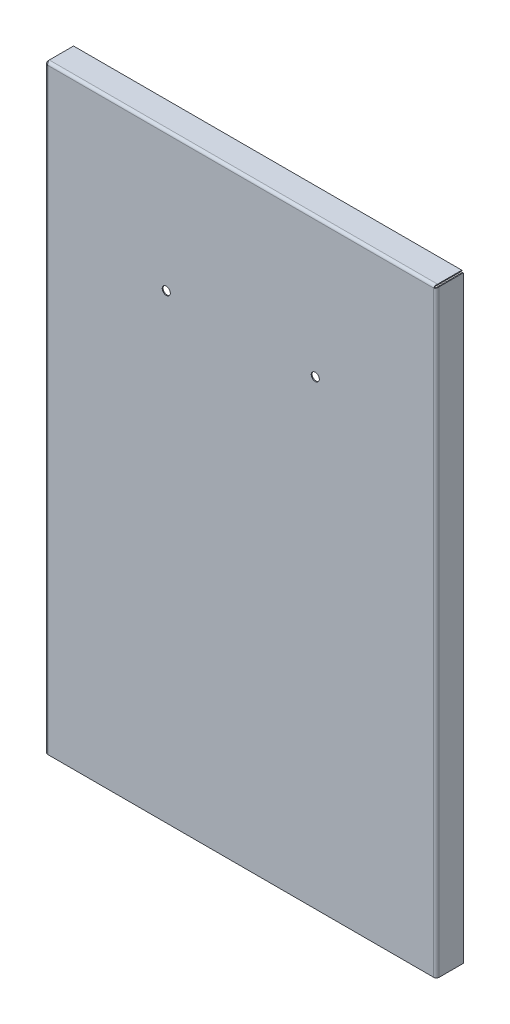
ISO-10303-21;
HEADER;
FILE_DESCRIPTION(('STEP AP214'),'2;1');
FILE_NAME('part.step','',(''),(''),'','','');
FILE_SCHEMA(('AUTOMOTIVE_DESIGN { 1 0 10303 214 1 1 1 1 }'));
ENDSEC;
DATA;
#1=APPLICATION_CONTEXT('core data for automotive mechanical design processes');
#2=APPLICATION_PROTOCOL_DEFINITION('international standard','automotive_design',2000,#1);
#3=PRODUCT_CONTEXT('',#1,'mechanical');
#4=PRODUCT('Part','Part','',(#3));
#5=PRODUCT_RELATED_PRODUCT_CATEGORY('part','',(#4));
#6=PRODUCT_DEFINITION_FORMATION('','',#4);
#7=PRODUCT_DEFINITION_CONTEXT('part definition',#1,'design');
#8=PRODUCT_DEFINITION('design','',#6,#7);
#9=PRODUCT_DEFINITION_SHAPE('','',#8);
#10=(LENGTH_UNIT() NAMED_UNIT(*) SI_UNIT(.MILLI.,.METRE.));
#11=(NAMED_UNIT(*) PLANE_ANGLE_UNIT() SI_UNIT($,.RADIAN.));
#12=(NAMED_UNIT(*) SI_UNIT($,.STERADIAN.) SOLID_ANGLE_UNIT());
#13=UNCERTAINTY_MEASURE_WITH_UNIT(LENGTH_MEASURE(1.E-05),#10,'distance_accuracy_value','');
#14=(GEOMETRIC_REPRESENTATION_CONTEXT(3) GLOBAL_UNCERTAINTY_ASSIGNED_CONTEXT((#13)) GLOBAL_UNIT_ASSIGNED_CONTEXT((#10,
#11,#12)) REPRESENTATION_CONTEXT('',''));
#15=CARTESIAN_POINT('',(0.,0.,0.));
#16=DIRECTION('',(0.,0.,1.));
#17=DIRECTION('',(1.,0.,0.));
#18=AXIS2_PLACEMENT_3D('',#15,#16,#17);
#19=CARTESIAN_POINT('',(0.,0.,0.));
#20=DIRECTION('',(0.,0.,-1.));
#21=DIRECTION('',(-1.,0.,0.));
#22=AXIS2_PLACEMENT_3D('',#19,#20,#21);
#23=PLANE('',#22);
#24=CARTESIAN_POINT('',(83.,179.41245810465,0.));
#25=DIRECTION('',(0.,0.,-1.));
#26=DIRECTION('',(-1.,0.,0.));
#27=AXIS2_PLACEMENT_3D('',#24,#25,#26);
#28=CIRCLE('',#27,4.50000000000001);
#29=CARTESIAN_POINT('',(78.5,179.41245810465,0.));
#30=VERTEX_POINT('',#29);
#31=EDGE_CURVE('E846',#30,#30,#28,.T.);
#32=ORIENTED_EDGE('',*,*,#31,.F.);
#33=EDGE_LOOP('',(#32));
#34=FACE_BOUND('',#33,.T.);
#35=CARTESIAN_POINT('',(-83.,179.41245810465,0.));
#36=DIRECTION('',(0.,0.,-1.));
#37=DIRECTION('',(-1.,0.,0.));
#38=AXIS2_PLACEMENT_3D('',#35,#36,#37);
#39=CIRCLE('',#38,4.50000000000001);
#40=CARTESIAN_POINT('',(-87.5,179.41245810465,0.));
#41=VERTEX_POINT('',#40);
#42=EDGE_CURVE('E243',#41,#41,#39,.T.);
#43=ORIENTED_EDGE('',*,*,#42,.F.);
#44=EDGE_LOOP('',(#43));
#45=FACE_BOUND('',#44,.T.);
#46=DIRECTION('',(1.,0.,0.));
#47=VECTOR('',#46,1.);
#48=CARTESIAN_POINT('',(-218.,-334.,0.));
#49=LINE('',#48,#47);
#50=CARTESIAN_POINT('',(-215.,-334.,0.));
#51=VERTEX_POINT('',#50);
#52=CARTESIAN_POINT('',(215.,-334.,0.));
#53=VERTEX_POINT('',#52);
#54=EDGE_CURVE('E13',#51,#53,#49,.T.);
#55=ORIENTED_EDGE('',*,*,#54,.F.);
#56=DIRECTION('',(0.,1.,0.));
#57=VECTOR('',#56,1.);
#58=CARTESIAN_POINT('',(-215.,332.292893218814,0.));
#59=LINE('',#58,#57);
#60=CARTESIAN_POINT('',(-215.,331.,0.));
#61=VERTEX_POINT('',#60);
#62=EDGE_CURVE('E253',#61,#51,#59,.F.);
#63=ORIENTED_EDGE('',*,*,#62,.F.);
#64=DIRECTION('',(1.,0.,0.));
#65=VECTOR('',#64,1.);
#66=CARTESIAN_POINT('',(216.292893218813,331.,0.));
#67=LINE('',#66,#65);
#68=CARTESIAN_POINT('',(215.,331.,0.));
#69=VERTEX_POINT('',#68);
#70=EDGE_CURVE('E119',#69,#61,#67,.F.);
#71=ORIENTED_EDGE('',*,*,#70,.F.);
#72=DIRECTION('',(0.,-1.,0.));
#73=VECTOR('',#72,1.);
#74=CARTESIAN_POINT('',(215.,-334.,0.));
#75=LINE('',#74,#73);
#76=EDGE_CURVE('E418',#53,#69,#75,.F.);
#77=ORIENTED_EDGE('',*,*,#76,.F.);
#78=EDGE_LOOP('',(#55,#63,#71,#77));
#79=FACE_BOUND('',#78,.T.);
#80=ADVANCED_FACE('F99',(#34,#45,#79),#23,.T.);
#81=CARTESIAN_POINT('',(0.,0.,1.));
#82=DIRECTION('',(0.,0.,-1.));
#83=DIRECTION('',(-1.,0.,0.));
#84=AXIS2_PLACEMENT_3D('',#81,#82,#83);
#85=PLANE('',#84);
#86=CARTESIAN_POINT('',(83.,179.41245810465,1.));
#87=DIRECTION('',(0.,0.,1.));
#88=DIRECTION('',(1.,0.,0.));
#89=AXIS2_PLACEMENT_3D('',#86,#87,#88);
#90=CIRCLE('',#89,4.50000000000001);
#91=CARTESIAN_POINT('',(87.5,179.41245810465,1.));
#92=VERTEX_POINT('',#91);
#93=EDGE_CURVE('E849',#92,#92,#90,.T.);
#94=ORIENTED_EDGE('',*,*,#93,.F.);
#95=EDGE_LOOP('',(#94));
#96=FACE_BOUND('',#95,.T.);
#97=CARTESIAN_POINT('',(-83.,179.41245810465,1.));
#98=DIRECTION('',(0.,0.,1.));
#99=DIRECTION('',(1.,0.,0.));
#100=AXIS2_PLACEMENT_3D('',#97,#98,#99);
#101=CIRCLE('',#100,4.50000000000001);
#102=CARTESIAN_POINT('',(-78.5,179.41245810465,1.));
#103=VERTEX_POINT('',#102);
#104=EDGE_CURVE('E851',#103,#103,#101,.T.);
#105=ORIENTED_EDGE('',*,*,#104,.F.);
#106=EDGE_LOOP('',(#105));
#107=FACE_BOUND('',#106,.T.);
#108=DIRECTION('',(0.,1.,0.));
#109=VECTOR('',#108,1.);
#110=CARTESIAN_POINT('',(-215.,332.292893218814,0.999999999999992));
#111=LINE('',#110,#109);
#112=CARTESIAN_POINT('',(-215.,331.,0.999999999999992));
#113=VERTEX_POINT('',#112);
#114=CARTESIAN_POINT('',(-215.,-334.,1.));
#115=VERTEX_POINT('',#114);
#116=EDGE_CURVE('E248',#113,#115,#111,.F.);
#117=ORIENTED_EDGE('',*,*,#116,.T.);
#118=DIRECTION('',(-1.,0.,0.));
#119=VECTOR('',#118,1.);
#120=CARTESIAN_POINT('',(0.,-334.,1.));
#121=LINE('',#120,#119);
#122=CARTESIAN_POINT('',(215.,-334.,0.999999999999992));
#123=VERTEX_POINT('',#122);
#124=EDGE_CURVE('E103',#115,#123,#121,.F.);
#125=ORIENTED_EDGE('',*,*,#124,.T.);
#126=DIRECTION('',(0.,-1.,0.));
#127=VECTOR('',#126,1.);
#128=CARTESIAN_POINT('',(215.,-334.,0.999999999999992));
#129=LINE('',#128,#127);
#130=CARTESIAN_POINT('',(215.,331.,0.999999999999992));
#131=VERTEX_POINT('',#130);
#132=EDGE_CURVE('E494',#123,#131,#129,.F.);
#133=ORIENTED_EDGE('',*,*,#132,.T.);
#134=DIRECTION('',(1.,0.,0.));
#135=VECTOR('',#134,1.);
#136=CARTESIAN_POINT('',(216.292893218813,331.,0.999999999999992));
#137=LINE('',#136,#135);
#138=EDGE_CURVE('E371',#131,#113,#137,.F.);
#139=ORIENTED_EDGE('',*,*,#138,.T.);
#140=EDGE_LOOP('',(#117,#125,#133,#139));
#141=FACE_BOUND('',#140,.T.);
#142=ADVANCED_FACE('F303',(#96,#107,#141),#85,.F.);
#143=CARTESIAN_POINT('',(-218.,-334.,0.));
#144=DIRECTION('',(0.,1.,0.));
#145=DIRECTION('',(1.,0.,0.));
#146=AXIS2_PLACEMENT_3D('',#143,#144,#145);
#147=PLANE('',#146);
#148=DIRECTION('',(0.,0.,1.));
#149=VECTOR('',#148,1.);
#150=CARTESIAN_POINT('',(-215.,-334.,0.));
#151=LINE('',#150,#149);
#152=EDGE_CURVE('E247',#51,#115,#151,.T.);
#153=ORIENTED_EDGE('',*,*,#152,.F.);
#154=ORIENTED_EDGE('',*,*,#54,.T.);
#155=DIRECTION('',(0.,0.,1.));
#156=VECTOR('',#155,1.);
#157=CARTESIAN_POINT('',(215.,-334.,0.));
#158=LINE('',#157,#156);
#159=EDGE_CURVE('E384',#53,#123,#158,.T.);
#160=ORIENTED_EDGE('',*,*,#159,.T.);
#161=ORIENTED_EDGE('',*,*,#124,.F.);
#162=EDGE_LOOP('',(#153,#154,#160,#161));
#163=FACE_BOUND('',#162,.T.);
#164=ADVANCED_FACE('F101',(#163),#147,.F.);
#165=CARTESIAN_POINT('',(-215.,331.,1.00999999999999));
#166=CARTESIAN_POINT('',(-215.10775918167,331.394074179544,1.00999999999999));
#167=CARTESIAN_POINT('',(-215.215482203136,331.787861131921,0.931657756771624));
#168=CARTESIAN_POINT('',(-215.430964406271,332.515893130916,0.630097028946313));
#169=CARTESIAN_POINT('',(-215.538705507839,332.849785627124,0.406997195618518));
#170=CARTESIAN_POINT('',(-215.754187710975,333.406997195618,-0.150214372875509));
#171=CARTESIAN_POINT('',(-215.861928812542,333.630097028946,-0.484106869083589));
#172=CARTESIAN_POINT('',(-216.077411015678,333.931657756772,-1.21213886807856));
#173=CARTESIAN_POINT('',(-216.185134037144,334.01,-1.60592582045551));
#174=CARTESIAN_POINT('',(-216.292893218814,334.01,-2.));
#175=CARTESIAN_POINT('',(-215.,331.,0.999999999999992));
#176=CARTESIAN_POINT('',(-215.107759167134,331.392764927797,0.999999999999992));
#177=CARTESIAN_POINT('',(-215.215482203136,331.785243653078,0.921918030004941));
#178=CARTESIAN_POINT('',(-215.430964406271,332.510856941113,0.62135916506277));
#179=CARTESIAN_POINT('',(-215.538705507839,332.843640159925,0.399000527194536));
#180=CARTESIAN_POINT('',(-215.754187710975,333.399000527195,-0.156359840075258));
#181=CARTESIAN_POINT('',(-215.861928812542,333.621359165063,-0.489143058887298));
#182=CARTESIAN_POINT('',(-216.077411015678,333.921918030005,-1.21475634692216));
#183=CARTESIAN_POINT('',(-216.18513405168,334.,-1.60723507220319));
#184=CARTESIAN_POINT('',(-216.292893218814,334.,-2.));
#185=CARTESIAN_POINT('',(-215.,331.,0.));
#186=CARTESIAN_POINT('',(-215.107757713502,331.261839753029,0.));
#187=CARTESIAN_POINT('',(-215.215482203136,331.523495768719,-0.0520546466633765));
#188=CARTESIAN_POINT('',(-215.430964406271,332.007237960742,-0.252427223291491));
#189=CARTESIAN_POINT('',(-215.538705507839,332.22909343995,-0.400666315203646));
#190=CARTESIAN_POINT('',(-215.754187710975,332.599333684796,-0.770906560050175));
#191=CARTESIAN_POINT('',(-215.861928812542,332.747572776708,-0.992762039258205));
#192=CARTESIAN_POINT('',(-216.077411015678,332.947945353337,-1.47650423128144));
#193=CARTESIAN_POINT('',(-216.185135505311,333.,-1.73816024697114));
#194=CARTESIAN_POINT('',(-216.292893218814,333.,-2.));
#195=CARTESIAN_POINT('',(-215.,331.,-0.0101000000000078));
#196=CARTESIAN_POINT('',(-215.107757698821,331.260517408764,-0.0101000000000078));
#197=CARTESIAN_POINT('',(-215.215482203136,331.520852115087,-0.0618917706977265));
#198=CARTESIAN_POINT('',(-215.430964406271,332.00215140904,-0.261252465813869));
#199=CARTESIAN_POINT('',(-215.538705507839,332.222886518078,-0.408742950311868));
#200=CARTESIAN_POINT('',(-215.754187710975,332.591257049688,-0.777113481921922));
#201=CARTESIAN_POINT('',(-215.861928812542,332.738747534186,-0.997848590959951));
#202=CARTESIAN_POINT('',(-216.077411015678,332.938108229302,-1.47914788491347));
#203=CARTESIAN_POINT('',(-216.185135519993,332.9899,-1.73948259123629));
#204=CARTESIAN_POINT('',(-216.292893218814,332.9899,-2.));
#205=B_SPLINE_SURFACE_WITH_KNOTS('',1,3,((#165,#166,#167,#168,#169,#170,#171,#172,#173,#174),
(#175,#176,#177,#178,#179,#180,#181,#182,#183,#184),(#185,#186,#187,#188,#189,#190,#191,#192,
#193,#194),(#195,#196,#197,#198,#199,#200,#201,#202,#203,#204)),.UNSPECIFIED.,.F.,.F.,.F.,(2,1,
1,2),(4,2,2,2,4),(-0.01,0.,1.,1.0101),(0.,0.25,0.5,0.75,1.),.UNSPECIFIED.);
#206=DIRECTION('',(0.,-1.,0.));
#207=VECTOR('',#206,1.);
#208=CARTESIAN_POINT('',(-216.292893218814,333.,-2.));
#209=LINE('',#208,#207);
#210=CARTESIAN_POINT('',(-216.292893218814,334.,-2.));
#211=VERTEX_POINT('',#210);
#212=CARTESIAN_POINT('',(-216.292893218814,333.,-2.));
#213=VERTEX_POINT('',#212);
#214=EDGE_CURVE('E346',#211,#213,#209,.T.);
#215=CARTESIAN_POINT('',(-215.,331.,0.));
#216=CARTESIAN_POINT('',(-215.025041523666,331.060845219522,7.4837045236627E-06));
#217=CARTESIAN_POINT('',(-215.050081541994,331.121687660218,-0.00277654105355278));
#218=CARTESIAN_POINT('',(-215.100159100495,331.242863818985,-0.0138703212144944));
#219=CARTESIAN_POINT('',(-215.125196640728,331.303197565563,-0.0221797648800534));
#220=CARTESIAN_POINT('',(-215.175252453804,331.422812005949,-0.0442582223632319));
#221=CARTESIAN_POINT('',(-215.200270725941,331.482093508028,-0.0580228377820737));
#222=CARTESIAN_POINT('',(-215.250302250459,331.599141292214,-0.0908823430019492));
#223=CARTESIAN_POINT('',(-215.275315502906,331.656907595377,-0.109977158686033));
#224=CARTESIAN_POINT('',(-215.350393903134,331.827318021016,-0.175088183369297));
#225=CARTESIAN_POINT('',(-215.40049720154,331.937072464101,-0.22893074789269));
#226=CARTESIAN_POINT('',(-215.500658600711,332.144892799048,-0.355601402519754));
#227=CARTESIAN_POINT('',(-215.550716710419,332.242962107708,-0.428423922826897));
#228=CARTESIAN_POINT('',(-215.650839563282,332.424263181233,-0.590651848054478));
#229=CARTESIAN_POINT('',(-215.70090430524,332.507496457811,-0.680055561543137));
#230=CARTESIAN_POINT('',(-215.801053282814,332.656392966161,-0.872536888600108));
#231=CARTESIAN_POINT('',(-215.851137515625,332.722047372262,-0.975621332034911));
#232=CARTESIAN_POINT('',(-215.951331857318,332.833582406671,-1.19203129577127));
#233=CARTESIAN_POINT('',(-216.001441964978,332.879451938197,-1.30536252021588));
#234=CARTESIAN_POINT('',(-216.101610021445,332.949784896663,-1.53837393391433));
#235=CARTESIAN_POINT('',(-216.151667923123,332.97428290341,-1.65804353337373));
#236=CARTESIAN_POINT('',(-216.216882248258,332.99182052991,-1.81553338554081));
#237=CARTESIAN_POINT('',(-216.232097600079,332.99488919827,-1.85239074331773));
#238=CARTESIAN_POINT('',(-216.262504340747,332.998976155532,-1.92616049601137));
#239=CARTESIAN_POINT('',(-216.277695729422,332.999997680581,-1.963072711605));
#240=CARTESIAN_POINT('',(-216.292893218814,333.,-2.));
#241=B_SPLINE_CURVE_WITH_KNOTS('',3,(#215,#216,#217,#218,#219,#220,#221,#222,#223,#224,#225,
#226,#227,#228,#229,#230,#231,#232,#233,#234,#235,#236,#237,#238,#239,#240),.UNSPECIFIED.,.F.,
.F.,(4,2,2,2,2,2,2,2,2,2,2,2,4),(0.,0.197325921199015,0.39464071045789,0.591796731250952,
0.788950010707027,1.18326045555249,1.5774553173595,1.97160998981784,2.36596218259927,
2.76053526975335,3.15446873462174,3.27440980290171,3.39416111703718),.UNSPECIFIED.);
#242=EDGE_CURVE('E347',#61,#213,#241,.T.);
#243=DIRECTION('',(0.,0.,1.));
#244=VECTOR('',#243,1.);
#245=CARTESIAN_POINT('',(-215.,331.,0.));
#246=LINE('',#245,#244);
#247=EDGE_CURVE('E374',#61,#113,#246,.T.);
#248=CARTESIAN_POINT('',(-215.,331.,0.999999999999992));
#249=CARTESIAN_POINT('',(-215.022621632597,331.082448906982,1.00000728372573));
#250=CARTESIAN_POINT('',(-215.045242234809,331.164894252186,0.996601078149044));
#251=CARTESIAN_POINT('',(-215.090480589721,331.329218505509,0.983018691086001));
#252=CARTESIAN_POINT('',(-215.113098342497,331.41109746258,0.972843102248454));
#253=CARTESIAN_POINT('',(-215.158327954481,331.573721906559,0.945782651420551));
#254=CARTESIAN_POINT('',(-215.180939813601,331.654467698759,0.928899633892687));
#255=CARTESIAN_POINT('',(-215.22615983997,331.814278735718,0.888555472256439));
#256=CARTESIAN_POINT('',(-215.248768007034,331.89334391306,0.865094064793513));
#257=CARTESIAN_POINT('',(-215.31936255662,332.136777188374,0.781770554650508));
#258=CARTESIAN_POINT('',(-215.367390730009,332.297424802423,0.710583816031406));
#259=CARTESIAN_POINT('',(-215.463407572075,332.603765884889,0.541377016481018));
#260=CARTESIAN_POINT('',(-215.511396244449,332.749460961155,0.443359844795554));
#261=CARTESIAN_POINT('',(-215.607385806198,333.021584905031,0.223460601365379));
#262=CARTESIAN_POINT('',(-215.655386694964,333.148014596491,0.101579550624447));
#263=CARTESIAN_POINT('',(-215.751393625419,333.377754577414,-0.162364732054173));
#264=CARTESIAN_POINT('',(-215.799399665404,333.481059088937,-0.304432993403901));
#265=CARTESIAN_POINT('',(-215.895425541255,333.661385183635,-0.604407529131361));
#266=CARTESIAN_POINT('',(-215.943445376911,333.738398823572,-0.762318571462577));
#267=CARTESIAN_POINT('',(-216.039464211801,333.86370066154,-1.08908154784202));
#268=CARTESIAN_POINT('',(-216.087463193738,333.912013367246,-1.25792401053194));
#269=CARTESIAN_POINT('',(-216.161694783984,333.963477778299,-1.52355278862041));
#270=CARTESIAN_POINT('',(-216.187957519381,333.977171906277,-1.61840625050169));
#271=CARTESIAN_POINT('',(-216.24043986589,333.995426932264,-1.80882577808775));
#272=CARTESIAN_POINT('',(-216.266659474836,334.000003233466,-1.9043903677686));
#273=CARTESIAN_POINT('',(-216.292893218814,334.,-2.));
#274=B_SPLINE_CURVE_WITH_KNOTS('',3,(#248,#249,#250,#251,#252,#253,#254,#255,#256,#257,#258,
#259,#260,#261,#262,#263,#264,#265,#266,#267,#268,#269,#270,#271,#272,#273),.UNSPECIFIED.,.F.,
.F.,(4,2,2,2,2,2,2,2,2,2,2,2,4),(0.,0.256413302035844,0.512804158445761,0.769124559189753,
1.02545522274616,1.56910054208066,2.1126873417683,2.65625088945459,3.19995009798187,
3.74381342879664,4.28721168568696,4.58494645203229,4.8821778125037),.UNSPECIFIED.);
#275=EDGE_CURVE('E364',#113,#211,#274,.T.);
#276=ORIENTED_EDGE('',*,*,#214,.T.);
#277=ORIENTED_EDGE('',*,*,#242,.F.);
#278=ORIENTED_EDGE('',*,*,#247,.T.);
#279=ORIENTED_EDGE('',*,*,#275,.T.);
#280=EDGE_LOOP('',(#276,#277,#278,#279));
#281=FACE_BOUND('',#280,.T.);
#282=ADVANCED_FACE('F320',(#281),#205,.F.);
#283=CARTESIAN_POINT('',(216.292893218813,334.01,-2.));
#284=CARTESIAN_POINT('',(216.185134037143,334.01,-1.60592582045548));
#285=CARTESIAN_POINT('',(216.077411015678,333.931657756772,-1.21213886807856));
#286=CARTESIAN_POINT('',(215.861928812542,333.630097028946,-0.484106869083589));
#287=CARTESIAN_POINT('',(215.754187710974,333.406997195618,-0.150214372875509));
#288=CARTESIAN_POINT('',(215.538705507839,332.849785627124,0.406997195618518));
#289=CARTESIAN_POINT('',(215.430964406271,332.515893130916,0.630097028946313));
#290=CARTESIAN_POINT('',(215.215482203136,331.787861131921,0.931657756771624));
#291=CARTESIAN_POINT('',(215.10775918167,331.394074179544,1.00999999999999));
#292=CARTESIAN_POINT('',(215.,331.,1.00999999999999));
#293=CARTESIAN_POINT('',(216.292893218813,334.,-2.));
#294=CARTESIAN_POINT('',(216.18513405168,334.,-1.60723507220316));
#295=CARTESIAN_POINT('',(216.077411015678,333.921918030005,-1.21475634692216));
#296=CARTESIAN_POINT('',(215.861928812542,333.621359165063,-0.489143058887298));
#297=CARTESIAN_POINT('',(215.754187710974,333.399000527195,-0.156359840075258));
#298=CARTESIAN_POINT('',(215.538705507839,332.843640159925,0.399000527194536));
#299=CARTESIAN_POINT('',(215.430964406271,332.510856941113,0.62135916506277));
#300=CARTESIAN_POINT('',(215.215482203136,331.785243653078,0.921918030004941));
#301=CARTESIAN_POINT('',(215.107759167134,331.392764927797,0.999999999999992));
#302=CARTESIAN_POINT('',(215.,331.,0.999999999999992));
#303=CARTESIAN_POINT('',(216.292893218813,333.,-2.));
#304=CARTESIAN_POINT('',(216.185135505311,333.,-1.73816024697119));
#305=CARTESIAN_POINT('',(216.077411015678,332.947945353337,-1.47650423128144));
#306=CARTESIAN_POINT('',(215.861928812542,332.747572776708,-0.992762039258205));
#307=CARTESIAN_POINT('',(215.754187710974,332.599333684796,-0.770906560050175));
#308=CARTESIAN_POINT('',(215.538705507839,332.22909343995,-0.400666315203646));
#309=CARTESIAN_POINT('',(215.430964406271,332.007237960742,-0.252427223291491));
#310=CARTESIAN_POINT('',(215.215482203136,331.523495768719,-0.0520546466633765));
#311=CARTESIAN_POINT('',(215.107757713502,331.261839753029,0.));
#312=CARTESIAN_POINT('',(215.,331.,0.));
#313=CARTESIAN_POINT('',(216.292893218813,332.9899,-2.));
#314=CARTESIAN_POINT('',(216.185135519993,332.9899,-1.73948259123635));
#315=CARTESIAN_POINT('',(216.077411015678,332.938108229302,-1.47914788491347));
#316=CARTESIAN_POINT('',(215.861928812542,332.738747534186,-0.997848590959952));
#317=CARTESIAN_POINT('',(215.754187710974,332.591257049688,-0.777113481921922));
#318=CARTESIAN_POINT('',(215.538705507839,332.222886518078,-0.408742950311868));
#319=CARTESIAN_POINT('',(215.430964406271,332.00215140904,-0.261252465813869));
#320=CARTESIAN_POINT('',(215.215482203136,331.520852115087,-0.0618917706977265));
#321=CARTESIAN_POINT('',(215.107757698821,331.260517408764,-0.0101000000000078));
#322=CARTESIAN_POINT('',(215.,331.,-0.0101000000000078));
#323=B_SPLINE_SURFACE_WITH_KNOTS('',1,3,((#283,#284,#285,#286,#287,#288,#289,#290,#291,#292),
(#293,#294,#295,#296,#297,#298,#299,#300,#301,#302),(#303,#304,#305,#306,#307,#308,#309,#310,
#311,#312),(#313,#314,#315,#316,#317,#318,#319,#320,#321,#322)),.UNSPECIFIED.,.F.,.F.,.F.,(2,1,
1,2),(4,2,2,2,4),(-0.01,0.,1.,1.0101),(0.,0.25,0.5,0.75,1.),.UNSPECIFIED.);
#324=CARTESIAN_POINT('',(216.292893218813,333.,-2.));
#325=CARTESIAN_POINT('',(216.267851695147,333.000007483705,-1.93915478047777));
#326=CARTESIAN_POINT('',(216.242811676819,332.997223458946,-1.87831233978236));
#327=CARTESIAN_POINT('',(216.192734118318,332.986129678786,-1.75713618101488));
#328=CARTESIAN_POINT('',(216.167696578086,332.97782023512,-1.69680243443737));
#329=CARTESIAN_POINT('',(216.117640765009,332.955741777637,-1.57718799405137));
#330=CARTESIAN_POINT('',(216.092622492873,332.941977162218,-1.51790649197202));
#331=CARTESIAN_POINT('',(216.042590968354,332.909117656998,-1.40085870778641));
#332=CARTESIAN_POINT('',(216.017577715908,332.890022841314,-1.34309240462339));
#333=CARTESIAN_POINT('',(215.942499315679,332.824911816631,-1.17268197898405));
#334=CARTESIAN_POINT('',(215.892396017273,332.771069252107,-1.06292753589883));
#335=CARTESIAN_POINT('',(215.792234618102,332.64439859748,-0.855107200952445));
#336=CARTESIAN_POINT('',(215.742176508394,332.571576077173,-0.757037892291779));
#337=CARTESIAN_POINT('',(215.642053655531,332.409348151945,-0.575736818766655));
#338=CARTESIAN_POINT('',(215.591988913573,332.319944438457,-0.492503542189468));
#339=CARTESIAN_POINT('',(215.491839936,332.1274631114,-0.343607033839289));
#340=CARTESIAN_POINT('',(215.441755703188,332.024378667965,-0.277952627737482));
#341=CARTESIAN_POINT('',(215.341561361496,331.807968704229,-0.166417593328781));
#342=CARTESIAN_POINT('',(215.291451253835,331.694637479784,-0.120548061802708));
#343=CARTESIAN_POINT('',(215.191283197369,331.461626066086,-0.0502151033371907));
#344=CARTESIAN_POINT('',(215.14122529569,331.341956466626,-0.0257170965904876));
#345=CARTESIAN_POINT('',(215.076010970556,331.184466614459,-0.00817947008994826));
#346=CARTESIAN_POINT('',(215.060795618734,331.147609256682,-0.00511080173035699));
#347=CARTESIAN_POINT('',(215.030388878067,331.073839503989,-0.00102384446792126));
#348=CARTESIAN_POINT('',(215.015197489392,331.036927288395,-2.31941933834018E-06));
#349=CARTESIAN_POINT('',(215.,331.,0.));
#350=B_SPLINE_CURVE_WITH_KNOTS('',3,(#324,#325,#326,#327,#328,#329,#330,#331,#332,#333,#334,
#335,#336,#337,#338,#339,#340,#341,#342,#343,#344,#345,#346,#347,#348,#349),.UNSPECIFIED.,.F.,
.F.,(4,2,2,2,2,2,2,2,2,2,2,2,4),(0.,0.197325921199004,0.394640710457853,0.591796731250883,
0.788950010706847,1.18326045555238,1.57745531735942,1.97160998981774,2.36596218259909,
2.76053526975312,3.15446873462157,3.27440980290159,3.39416111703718),.UNSPECIFIED.);
#351=CARTESIAN_POINT('',(216.292893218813,333.,-2.));
#352=VERTEX_POINT('',#351);
#353=EDGE_CURVE('E341',#352,#69,#350,.T.);
#354=DIRECTION('',(0.,1.,0.));
#355=VECTOR('',#354,1.);
#356=CARTESIAN_POINT('',(216.292893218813,333.,-2.));
#357=LINE('',#356,#355);
#358=CARTESIAN_POINT('',(216.292893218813,334.,-2.));
#359=VERTEX_POINT('',#358);
#360=EDGE_CURVE('E405',#359,#352,#357,.F.);
#361=CARTESIAN_POINT('',(216.292893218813,334.,-2.));
#362=CARTESIAN_POINT('',(216.270271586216,334.000007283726,-1.91755109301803));
#363=CARTESIAN_POINT('',(216.247650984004,333.996601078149,-1.83510574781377));
#364=CARTESIAN_POINT('',(216.202412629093,333.983018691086,-1.67078149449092));
#365=CARTESIAN_POINT('',(216.179794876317,333.972843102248,-1.58890253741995));
#366=CARTESIAN_POINT('',(216.134565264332,333.945782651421,-1.42627809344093));
#367=CARTESIAN_POINT('',(216.111953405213,333.928899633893,-1.34553230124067));
#368=CARTESIAN_POINT('',(216.066733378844,333.888555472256,-1.18572126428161));
#369=CARTESIAN_POINT('',(216.044125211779,333.865094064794,-1.10665608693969));
#370=CARTESIAN_POINT('',(215.973530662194,333.781770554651,-0.86322281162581));
#371=CARTESIAN_POINT('',(215.925502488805,333.710583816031,-0.702575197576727));
#372=CARTESIAN_POINT('',(215.829485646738,333.541377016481,-0.396234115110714));
#373=CARTESIAN_POINT('',(215.781496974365,333.443359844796,-0.250539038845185));
#374=CARTESIAN_POINT('',(215.685507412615,333.223460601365,0.021584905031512));
#375=CARTESIAN_POINT('',(215.637506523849,333.101579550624,0.148014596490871));
#376=CARTESIAN_POINT('',(215.541499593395,332.837635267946,0.377754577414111));
#377=CARTESIAN_POINT('',(215.493493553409,332.695567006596,0.481059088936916));
#378=CARTESIAN_POINT('',(215.397467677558,332.395592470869,0.661385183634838));
#379=CARTESIAN_POINT('',(215.349447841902,332.237681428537,0.738398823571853));
#380=CARTESIAN_POINT('',(215.253429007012,331.910918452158,0.863700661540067));
#381=CARTESIAN_POINT('',(215.205430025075,331.742075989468,0.912013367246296));
#382=CARTESIAN_POINT('',(215.13119843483,331.47644721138,0.963477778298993));
#383=CARTESIAN_POINT('',(215.104935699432,331.381593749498,0.977171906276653));
#384=CARTESIAN_POINT('',(215.052453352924,331.191174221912,0.995426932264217));
#385=CARTESIAN_POINT('',(215.026233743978,331.095609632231,1.00000323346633));
#386=CARTESIAN_POINT('',(215.,331.,0.999999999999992));
#387=B_SPLINE_CURVE_WITH_KNOTS('',3,(#361,#362,#363,#364,#365,#366,#367,#368,#369,#370,#371,
#372,#373,#374,#375,#376,#377,#378,#379,#380,#381,#382,#383,#384,#385,#386),.UNSPECIFIED.,.F.,
.F.,(4,2,2,2,2,2,2,2,2,2,2,2,4),(0.,0.256413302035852,0.512804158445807,0.769124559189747,
1.02545522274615,1.56910054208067,2.11268734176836,2.65625088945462,3.19995009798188,
3.74381342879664,4.28721168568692,4.58494645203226,4.88217781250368),.UNSPECIFIED.);
#388=EDGE_CURVE('E333',#359,#131,#387,.T.);
#389=DIRECTION('',(0.,0.,1.));
#390=VECTOR('',#389,1.);
#391=CARTESIAN_POINT('',(215.,331.,0.));
#392=LINE('',#391,#390);
#393=EDGE_CURVE('E370',#69,#131,#392,.T.);
#394=ORIENTED_EDGE('',*,*,#353,.F.);
#395=ORIENTED_EDGE('',*,*,#360,.F.);
#396=ORIENTED_EDGE('',*,*,#388,.T.);
#397=ORIENTED_EDGE('',*,*,#393,.F.);
#398=EDGE_LOOP('',(#394,#395,#396,#397));
#399=FACE_BOUND('',#398,.T.);
#400=ADVANCED_FACE('F313',(#399),#323,.F.);
#401=CARTESIAN_POINT('',(216.292893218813,331.,-2.00000000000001));
#402=DIRECTION('',(1.,0.,0.));
#403=DIRECTION('',(0.,1.,0.));
#404=AXIS2_PLACEMENT_3D('',#401,#402,#403);
#405=CYLINDRICAL_SURFACE('',#404,3.);
#406=ORIENTED_EDGE('',*,*,#138,.F.);
#407=ORIENTED_EDGE('',*,*,#388,.F.);
#408=DIRECTION('',(1.,0.,0.));
#409=VECTOR('',#408,1.);
#410=CARTESIAN_POINT('',(-218.,334.,-2.));
#411=LINE('',#410,#409);
#412=EDGE_CURVE('E397',#359,#211,#411,.F.);
#413=ORIENTED_EDGE('',*,*,#412,.T.);
#414=ORIENTED_EDGE('',*,*,#275,.F.);
#415=EDGE_LOOP('',(#406,#407,#413,#414));
#416=FACE_BOUND('',#415,.T.);
#417=ADVANCED_FACE('F319',(#416),#405,.T.);
#418=CARTESIAN_POINT('',(216.292893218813,331.,-2.00000000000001));
#419=DIRECTION('',(1.,0.,0.));
#420=DIRECTION('',(0.,1.,0.));
#421=AXIS2_PLACEMENT_3D('',#418,#419,#420);
#422=CYLINDRICAL_SURFACE('',#421,2.);
#423=ORIENTED_EDGE('',*,*,#70,.T.);
#424=ORIENTED_EDGE('',*,*,#242,.T.);
#425=DIRECTION('',(1.,0.,0.));
#426=VECTOR('',#425,1.);
#427=CARTESIAN_POINT('',(-218.,333.,-2.));
#428=LINE('',#427,#426);
#429=EDGE_CURVE('E395',#213,#352,#428,.T.);
#430=ORIENTED_EDGE('',*,*,#429,.T.);
#431=ORIENTED_EDGE('',*,*,#353,.T.);
#432=EDGE_LOOP('',(#423,#424,#430,#431));
#433=FACE_BOUND('',#432,.T.);
#434=ADVANCED_FACE('F351',(#433),#422,.F.);
#435=CARTESIAN_POINT('',(-216.292893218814,333.,0.));
#436=DIRECTION('',(-1.,0.,0.));
#437=DIRECTION('',(0.,0.,1.));
#438=AXIS2_PLACEMENT_3D('',#435,#436,#437);
#439=PLANE('',#438);
#440=DIRECTION('',(0.,0.,1.));
#441=VECTOR('',#440,1.);
#442=CARTESIAN_POINT('',(-216.292893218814,334.,0.));
#443=LINE('',#442,#441);
#444=CARTESIAN_POINT('',(-216.292893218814,334.,-29.));
#445=VERTEX_POINT('',#444);
#446=EDGE_CURVE('E383',#211,#445,#443,.F.);
#447=ORIENTED_EDGE('',*,*,#446,.T.);
#448=DIRECTION('',(0.,1.,0.));
#449=VECTOR('',#448,1.);
#450=CARTESIAN_POINT('',(-216.292893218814,333.,-29.));
#451=LINE('',#450,#449);
#452=CARTESIAN_POINT('',(-216.292893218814,333.,-29.));
#453=VERTEX_POINT('',#452);
#454=EDGE_CURVE('E386',#445,#453,#451,.F.);
#455=ORIENTED_EDGE('',*,*,#454,.T.);
#456=DIRECTION('',(0.,0.,-1.));
#457=VECTOR('',#456,1.);
#458=CARTESIAN_POINT('',(-216.292893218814,333.,1.27867065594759E-12));
#459=LINE('',#458,#457);
#460=EDGE_CURVE('E380',#213,#453,#459,.T.);
#461=ORIENTED_EDGE('',*,*,#460,.F.);
#462=ORIENTED_EDGE('',*,*,#214,.F.);
#463=EDGE_LOOP('',(#447,#455,#461,#462));
#464=FACE_BOUND('',#463,.T.);
#465=ADVANCED_FACE('F354',(#464),#439,.T.);
#466=CARTESIAN_POINT('',(0.,334.,1.28216213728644E-12));
#467=DIRECTION('',(0.,-1.,0.));
#468=DIRECTION('',(0.,0.,-1.));
#469=AXIS2_PLACEMENT_3D('',#466,#467,#468);
#470=PLANE('',#469);
#471=ORIENTED_EDGE('',*,*,#446,.F.);
#472=ORIENTED_EDGE('',*,*,#412,.F.);
#473=DIRECTION('',(0.,0.,-1.));
#474=VECTOR('',#473,1.);
#475=CARTESIAN_POINT('',(216.292893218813,334.,1.28216213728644E-12));
#476=LINE('',#475,#474);
#477=CARTESIAN_POINT('',(216.292893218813,334.,-29.));
#478=VERTEX_POINT('',#477);
#479=EDGE_CURVE('E391',#359,#478,#476,.T.);
#480=ORIENTED_EDGE('',*,*,#479,.T.);
#481=DIRECTION('',(-1.,0.,0.));
#482=VECTOR('',#481,1.);
#483=CARTESIAN_POINT('',(0.,334.,-29.));
#484=LINE('',#483,#482);
#485=EDGE_CURVE('E402',#478,#445,#484,.T.);
#486=ORIENTED_EDGE('',*,*,#485,.T.);
#487=EDGE_LOOP('',(#471,#472,#480,#486));
#488=FACE_BOUND('',#487,.T.);
#489=ADVANCED_FACE('F521',(#488),#470,.F.);
#490=CARTESIAN_POINT('',(0.,333.,1.27867065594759E-12));
#491=DIRECTION('',(0.,-1.,0.));
#492=DIRECTION('',(0.,0.,-1.));
#493=AXIS2_PLACEMENT_3D('',#490,#491,#492);
#494=PLANE('',#493);
#495=ORIENTED_EDGE('',*,*,#429,.F.);
#496=ORIENTED_EDGE('',*,*,#460,.T.);
#497=DIRECTION('',(1.,0.,0.));
#498=VECTOR('',#497,1.);
#499=CARTESIAN_POINT('',(-218.,333.,-29.));
#500=LINE('',#499,#498);
#501=CARTESIAN_POINT('',(216.292893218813,333.,-29.));
#502=VERTEX_POINT('',#501);
#503=EDGE_CURVE('E399',#502,#453,#500,.F.);
#504=ORIENTED_EDGE('',*,*,#503,.F.);
#505=DIRECTION('',(0.,0.,1.));
#506=VECTOR('',#505,1.);
#507=CARTESIAN_POINT('',(216.292893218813,333.,0.));
#508=LINE('',#507,#506);
#509=EDGE_CURVE('E388',#352,#502,#508,.F.);
#510=ORIENTED_EDGE('',*,*,#509,.F.);
#511=EDGE_LOOP('',(#495,#496,#504,#510));
#512=FACE_BOUND('',#511,.T.);
#513=ADVANCED_FACE('F527',(#512),#494,.T.);
#514=CARTESIAN_POINT('',(-218.,334.,-29.));
#515=DIRECTION('',(0.,0.,1.));
#516=DIRECTION('',(0.,-1.,0.));
#517=AXIS2_PLACEMENT_3D('',#514,#515,#516);
#518=PLANE('',#517);
#519=ORIENTED_EDGE('',*,*,#454,.F.);
#520=ORIENTED_EDGE('',*,*,#485,.F.);
#521=DIRECTION('',(0.,-1.,0.));
#522=VECTOR('',#521,1.);
#523=CARTESIAN_POINT('',(216.292893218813,334.,-29.));
#524=LINE('',#523,#522);
#525=EDGE_CURVE('E393',#478,#502,#524,.T.);
#526=ORIENTED_EDGE('',*,*,#525,.T.);
#527=ORIENTED_EDGE('',*,*,#503,.T.);
#528=EDGE_LOOP('',(#519,#520,#526,#527));
#529=FACE_BOUND('',#528,.T.);
#530=ADVANCED_FACE('F361',(#529),#518,.F.);
#531=CARTESIAN_POINT('',(216.292893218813,333.,0.));
#532=DIRECTION('',(-1.,0.,0.));
#533=DIRECTION('',(0.,0.,1.));
#534=AXIS2_PLACEMENT_3D('',#531,#532,#533);
#535=PLANE('',#534);
#536=ORIENTED_EDGE('',*,*,#525,.F.);
#537=ORIENTED_EDGE('',*,*,#479,.F.);
#538=ORIENTED_EDGE('',*,*,#360,.T.);
#539=ORIENTED_EDGE('',*,*,#509,.T.);
#540=EDGE_LOOP('',(#536,#537,#538,#539));
#541=FACE_BOUND('',#540,.T.);
#542=ADVANCED_FACE('F517',(#541),#535,.F.);
#543=CARTESIAN_POINT('',(215.,331.,1.00999999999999));
#544=CARTESIAN_POINT('',(215.394074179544,331.10775918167,1.00999999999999));
#545=CARTESIAN_POINT('',(215.787861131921,331.215482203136,0.931657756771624));
#546=CARTESIAN_POINT('',(216.515893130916,331.430964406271,0.630097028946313));
#547=CARTESIAN_POINT('',(216.849785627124,331.538705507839,0.406997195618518));
#548=CARTESIAN_POINT('',(217.406997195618,331.754187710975,-0.150214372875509));
#549=CARTESIAN_POINT('',(217.630097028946,331.861928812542,-0.484106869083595));
#550=CARTESIAN_POINT('',(217.931657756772,332.077411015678,-1.21213886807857));
#551=CARTESIAN_POINT('',(218.01,332.185134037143,-1.60592582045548));
#552=CARTESIAN_POINT('',(218.01,332.292893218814,-2.));
#553=CARTESIAN_POINT('',(215.,331.,0.999999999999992));
#554=CARTESIAN_POINT('',(215.392764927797,331.107759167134,0.999999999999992));
#555=CARTESIAN_POINT('',(215.785243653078,331.215482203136,0.921918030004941));
#556=CARTESIAN_POINT('',(216.510856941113,331.430964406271,0.62135916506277));
#557=CARTESIAN_POINT('',(216.843640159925,331.538705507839,0.399000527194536));
#558=CARTESIAN_POINT('',(217.399000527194,331.754187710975,-0.156359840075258));
#559=CARTESIAN_POINT('',(217.621359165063,331.861928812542,-0.489143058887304));
#560=CARTESIAN_POINT('',(217.921918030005,332.077411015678,-1.21475634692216));
#561=CARTESIAN_POINT('',(218.,332.18513405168,-1.60723507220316));
#562=CARTESIAN_POINT('',(218.,332.292893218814,-2.));
#563=CARTESIAN_POINT('',(215.,331.,0.));
#564=CARTESIAN_POINT('',(215.261839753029,331.107757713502,0.));
#565=CARTESIAN_POINT('',(215.523495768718,331.215482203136,-0.0520546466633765));
#566=CARTESIAN_POINT('',(216.007237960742,331.430964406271,-0.252427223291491));
#567=CARTESIAN_POINT('',(216.22909343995,331.538705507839,-0.400666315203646));
#568=CARTESIAN_POINT('',(216.599333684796,331.754187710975,-0.770906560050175));
#569=CARTESIAN_POINT('',(216.747572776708,331.861928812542,-0.992762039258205));
#570=CARTESIAN_POINT('',(216.947945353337,332.077411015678,-1.47650423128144));
#571=CARTESIAN_POINT('',(217.,332.185135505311,-1.73816024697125));
#572=CARTESIAN_POINT('',(217.,332.292893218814,-2.));
#573=CARTESIAN_POINT('',(215.,331.,-0.0101000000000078));
#574=CARTESIAN_POINT('',(215.260517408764,331.107757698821,-0.0101000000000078));
#575=CARTESIAN_POINT('',(215.520852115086,331.215482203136,-0.0618917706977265));
#576=CARTESIAN_POINT('',(216.00215140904,331.430964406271,-0.261252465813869));
#577=CARTESIAN_POINT('',(216.222886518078,331.538705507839,-0.408742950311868));
#578=CARTESIAN_POINT('',(216.591257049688,331.754187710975,-0.777113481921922));
#579=CARTESIAN_POINT('',(216.738747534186,331.861928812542,-0.997848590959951));
#580=CARTESIAN_POINT('',(216.938108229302,332.077411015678,-1.47914788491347));
#581=CARTESIAN_POINT('',(216.9899,332.185135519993,-1.73948259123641));
#582=CARTESIAN_POINT('',(216.9899,332.292893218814,-2.));
#583=B_SPLINE_SURFACE_WITH_KNOTS('',1,3,((#543,#544,#545,#546,#547,#548,#549,#550,#551,#552),
(#553,#554,#555,#556,#557,#558,#559,#560,#561,#562),(#563,#564,#565,#566,#567,#568,#569,#570,
#571,#572),(#573,#574,#575,#576,#577,#578,#579,#580,#581,#582)),.UNSPECIFIED.,.F.,.F.,.F.,(2,1,
1,2),(4,2,2,2,4),(-0.01,0.,1.,1.0101),(0.,0.25,0.5,0.75,1.),.UNSPECIFIED.);
#584=DIRECTION('',(-1.,0.,0.));
#585=VECTOR('',#584,1.);
#586=CARTESIAN_POINT('',(217.,332.292893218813,-2.));
#587=LINE('',#586,#585);
#588=CARTESIAN_POINT('',(218.,332.292893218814,-2.));
#589=VERTEX_POINT('',#588);
#590=CARTESIAN_POINT('',(217.,332.292893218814,-2.));
#591=VERTEX_POINT('',#590);
#592=EDGE_CURVE('E462',#589,#591,#587,.T.);
#593=CARTESIAN_POINT('',(215.,331.,0.));
#594=CARTESIAN_POINT('',(215.060845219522,331.025041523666,7.48370452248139E-06));
#595=CARTESIAN_POINT('',(215.121687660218,331.050081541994,-0.00277654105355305));
#596=CARTESIAN_POINT('',(215.242863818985,331.100159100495,-0.0138703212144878));
#597=CARTESIAN_POINT('',(215.303197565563,331.125196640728,-0.0221797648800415));
#598=CARTESIAN_POINT('',(215.422812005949,331.175252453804,-0.0442582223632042));
#599=CARTESIAN_POINT('',(215.482093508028,331.200270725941,-0.0580228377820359));
#600=CARTESIAN_POINT('',(215.599141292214,331.250302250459,-0.0908823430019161));
#601=CARTESIAN_POINT('',(215.656907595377,331.275315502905,-0.109977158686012));
#602=CARTESIAN_POINT('',(215.827318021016,331.350393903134,-0.175088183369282));
#603=CARTESIAN_POINT('',(215.937072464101,331.40049720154,-0.228930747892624));
#604=CARTESIAN_POINT('',(216.144892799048,331.500658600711,-0.355601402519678));
#605=CARTESIAN_POINT('',(216.242962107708,331.550716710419,-0.428423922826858));
#606=CARTESIAN_POINT('',(216.424263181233,331.650839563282,-0.59065184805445));
#607=CARTESIAN_POINT('',(216.50749645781,331.70090430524,-0.680055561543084));
#608=CARTESIAN_POINT('',(216.656392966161,331.801053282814,-0.872536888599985));
#609=CARTESIAN_POINT('',(216.722047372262,331.851137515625,-0.97562133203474));
#610=CARTESIAN_POINT('',(216.833582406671,331.951331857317,-1.19203129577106));
#611=CARTESIAN_POINT('',(216.879451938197,332.001441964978,-1.30536252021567));
#612=CARTESIAN_POINT('',(216.949784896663,332.101610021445,-1.53837393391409));
#613=CARTESIAN_POINT('',(216.974282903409,332.151667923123,-1.65804353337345));
#614=CARTESIAN_POINT('',(216.99182052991,332.216882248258,-1.81553338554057));
#615=CARTESIAN_POINT('',(216.99488919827,332.232097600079,-1.85239074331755));
#616=CARTESIAN_POINT('',(216.998976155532,332.262504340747,-1.9261604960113));
#617=CARTESIAN_POINT('',(216.999997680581,332.277695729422,-1.96307271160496));
#618=CARTESIAN_POINT('',(217.,332.292893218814,-2.));
#619=B_SPLINE_CURVE_WITH_KNOTS('',3,(#593,#594,#595,#596,#597,#598,#599,#600,#601,#602,#603,
#604,#605,#606,#607,#608,#609,#610,#611,#612,#613,#614,#615,#616,#617,#618),.UNSPECIFIED.,.F.,
.F.,(4,2,2,2,2,2,2,2,2,2,2,2,4),(0.,0.197325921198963,0.394640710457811,0.59179673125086,
0.788950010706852,1.18326045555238,1.57745531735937,1.97160998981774,2.36596218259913,
2.76053526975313,3.15446873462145,3.27440980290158,3.3941611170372),.UNSPECIFIED.);
#620=EDGE_CURVE('E409',#69,#591,#619,.T.);
#621=CARTESIAN_POINT('',(215.,331.,0.999999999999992));
#622=CARTESIAN_POINT('',(215.082448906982,331.022621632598,1.00000728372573));
#623=CARTESIAN_POINT('',(215.164894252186,331.045242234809,0.996601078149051));
#624=CARTESIAN_POINT('',(215.329218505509,331.090480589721,0.983018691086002));
#625=CARTESIAN_POINT('',(215.41109746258,331.113098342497,0.972843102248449));
#626=CARTESIAN_POINT('',(215.573721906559,331.158327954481,0.945782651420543));
#627=CARTESIAN_POINT('',(215.654467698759,331.180939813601,0.928899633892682));
#628=CARTESIAN_POINT('',(215.814278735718,331.22615983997,0.888555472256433));
#629=CARTESIAN_POINT('',(215.89334391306,331.248768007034,0.865094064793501));
#630=CARTESIAN_POINT('',(216.136777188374,331.31936255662,0.781770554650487));
#631=CARTESIAN_POINT('',(216.297424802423,331.367390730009,0.710583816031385));
#632=CARTESIAN_POINT('',(216.603765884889,331.463407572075,0.541377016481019));
#633=CARTESIAN_POINT('',(216.749460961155,331.511396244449,0.443359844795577));
#634=CARTESIAN_POINT('',(217.021584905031,331.607385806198,0.22346060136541));
#635=CARTESIAN_POINT('',(217.148014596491,331.655386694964,0.101579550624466));
#636=CARTESIAN_POINT('',(217.377754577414,331.751393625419,-0.162364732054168));
#637=CARTESIAN_POINT('',(217.481059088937,331.799399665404,-0.304432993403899));
#638=CARTESIAN_POINT('',(217.661385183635,331.895425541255,-0.604407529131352));
#639=CARTESIAN_POINT('',(217.738398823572,331.943445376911,-0.762318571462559));
#640=CARTESIAN_POINT('',(217.86370066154,332.039464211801,-1.089081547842));
#641=CARTESIAN_POINT('',(217.912013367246,332.087463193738,-1.25792401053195));
#642=CARTESIAN_POINT('',(217.963477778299,332.161694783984,-1.5235527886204));
#643=CARTESIAN_POINT('',(217.977171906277,332.187957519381,-1.61840625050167));
#644=CARTESIAN_POINT('',(217.995426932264,332.24043986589,-1.80882577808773));
#645=CARTESIAN_POINT('',(218.000003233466,332.266659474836,-1.90439036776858));
#646=CARTESIAN_POINT('',(218.,332.292893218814,-2.));
#647=B_SPLINE_CURVE_WITH_KNOTS('',3,(#621,#622,#623,#624,#625,#626,#627,#628,#629,#630,#631,
#632,#633,#634,#635,#636,#637,#638,#639,#640,#641,#642,#643,#644,#645,#646),.UNSPECIFIED.,.F.,
.F.,(4,2,2,2,2,2,2,2,2,2,2,2,4),(0.,0.256413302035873,0.512804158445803,0.769124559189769,
1.02545522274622,1.56910054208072,2.11268734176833,2.65625088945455,3.19995009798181,
3.74381342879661,4.28721168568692,4.58494645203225,4.88217781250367),.UNSPECIFIED.);
#648=EDGE_CURVE('E419',#131,#589,#647,.T.);
#649=ORIENTED_EDGE('',*,*,#592,.T.);
#650=ORIENTED_EDGE('',*,*,#620,.F.);
#651=ORIENTED_EDGE('',*,*,#393,.T.);
#652=ORIENTED_EDGE('',*,*,#648,.T.);
#653=EDGE_LOOP('',(#649,#650,#651,#652));
#654=FACE_BOUND('',#653,.T.);
#655=ADVANCED_FACE('F425',(#654),#583,.F.);
#656=CARTESIAN_POINT('',(215.,-334.,-2.00000000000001));
#657=DIRECTION('',(0.,1.,0.));
#658=DIRECTION('',(0.,0.,1.));
#659=AXIS2_PLACEMENT_3D('',#656,#657,#658);
#660=PLANE('',#659);
#661=CARTESIAN_POINT('',(215.,-334.,-2.00000000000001));
#662=DIRECTION('',(0.,-1.,0.));
#663=DIRECTION('',(0.,0.,-1.));
#664=AXIS2_PLACEMENT_3D('',#661,#662,#663);
#665=CIRCLE('',#664,2.);
#666=CARTESIAN_POINT('',(217.,-334.,-2.));
#667=VERTEX_POINT('',#666);
#668=EDGE_CURVE('E495',#667,#53,#665,.T.);
#669=ORIENTED_EDGE('',*,*,#668,.F.);
#670=DIRECTION('',(-1.,0.,0.));
#671=VECTOR('',#670,1.);
#672=CARTESIAN_POINT('',(217.,-334.,-2.));
#673=LINE('',#672,#671);
#674=CARTESIAN_POINT('',(218.,-334.,-2.));
#675=VERTEX_POINT('',#674);
#676=EDGE_CURVE('E487',#667,#675,#673,.F.);
#677=ORIENTED_EDGE('',*,*,#676,.T.);
#678=CARTESIAN_POINT('',(215.,-334.,-2.00000000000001));
#679=DIRECTION('',(0.,-1.,0.));
#680=DIRECTION('',(0.,0.,-1.));
#681=AXIS2_PLACEMENT_3D('',#678,#679,#680);
#682=CIRCLE('',#681,3.);
#683=EDGE_CURVE('E417',#675,#123,#682,.T.);
#684=ORIENTED_EDGE('',*,*,#683,.T.);
#685=ORIENTED_EDGE('',*,*,#159,.F.);
#686=EDGE_LOOP('',(#669,#677,#684,#685));
#687=FACE_BOUND('',#686,.T.);
#688=ADVANCED_FACE('F438',(#687),#660,.F.);
#689=CARTESIAN_POINT('',(215.,-334.,-2.00000000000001));
#690=DIRECTION('',(0.,-1.,0.));
#691=DIRECTION('',(1.,0.,0.));
#692=AXIS2_PLACEMENT_3D('',#689,#690,#691);
#693=CYLINDRICAL_SURFACE('',#692,3.);
#694=ORIENTED_EDGE('',*,*,#132,.F.);
#695=ORIENTED_EDGE('',*,*,#683,.F.);
#696=DIRECTION('',(0.,-1.,0.));
#697=VECTOR('',#696,1.);
#698=CARTESIAN_POINT('',(218.,334.,-2.));
#699=LINE('',#698,#697);
#700=EDGE_CURVE('E485',#675,#589,#699,.F.);
#701=ORIENTED_EDGE('',*,*,#700,.T.);
#702=ORIENTED_EDGE('',*,*,#648,.F.);
#703=EDGE_LOOP('',(#694,#695,#701,#702));
#704=FACE_BOUND('',#703,.T.);
#705=ADVANCED_FACE('F434',(#704),#693,.T.);
#706=CARTESIAN_POINT('',(215.,-334.,-2.00000000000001));
#707=DIRECTION('',(0.,-1.,0.));
#708=DIRECTION('',(1.,0.,0.));
#709=AXIS2_PLACEMENT_3D('',#706,#707,#708);
#710=CYLINDRICAL_SURFACE('',#709,2.);
#711=ORIENTED_EDGE('',*,*,#76,.T.);
#712=ORIENTED_EDGE('',*,*,#620,.T.);
#713=DIRECTION('',(0.,-1.,0.));
#714=VECTOR('',#713,1.);
#715=CARTESIAN_POINT('',(217.,334.,-2.));
#716=LINE('',#715,#714);
#717=EDGE_CURVE('E473',#591,#667,#716,.T.);
#718=ORIENTED_EDGE('',*,*,#717,.T.);
#719=ORIENTED_EDGE('',*,*,#668,.T.);
#720=EDGE_LOOP('',(#711,#712,#718,#719));
#721=FACE_BOUND('',#720,.T.);
#722=ADVANCED_FACE('F430',(#721),#710,.F.);
#723=CARTESIAN_POINT('',(217.,332.292893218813,0.));
#724=DIRECTION('',(0.,1.,0.));
#725=DIRECTION('',(0.,0.,1.));
#726=AXIS2_PLACEMENT_3D('',#723,#724,#725);
#727=PLANE('',#726);
#728=DIRECTION('',(0.,0.,1.));
#729=VECTOR('',#728,1.);
#730=CARTESIAN_POINT('',(218.,332.292893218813,0.));
#731=LINE('',#730,#729);
#732=CARTESIAN_POINT('',(218.,332.292893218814,-29.));
#733=VERTEX_POINT('',#732);
#734=EDGE_CURVE('E457',#589,#733,#731,.F.);
#735=ORIENTED_EDGE('',*,*,#734,.T.);
#736=DIRECTION('',(1.,0.,0.));
#737=VECTOR('',#736,1.);
#738=CARTESIAN_POINT('',(217.,332.292893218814,-29.));
#739=LINE('',#738,#737);
#740=CARTESIAN_POINT('',(217.,332.292893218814,-29.));
#741=VERTEX_POINT('',#740);
#742=EDGE_CURVE('E460',#733,#741,#739,.F.);
#743=ORIENTED_EDGE('',*,*,#742,.T.);
#744=DIRECTION('',(0.,0.,-1.));
#745=VECTOR('',#744,1.);
#746=CARTESIAN_POINT('',(217.,332.292893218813,3.15497031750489E-12));
#747=LINE('',#746,#745);
#748=EDGE_CURVE('E260',#591,#741,#747,.T.);
#749=ORIENTED_EDGE('',*,*,#748,.F.);
#750=ORIENTED_EDGE('',*,*,#592,.F.);
#751=EDGE_LOOP('',(#735,#743,#749,#750));
#752=FACE_BOUND('',#751,.T.);
#753=ADVANCED_FACE('F433',(#752),#727,.T.);
#754=CARTESIAN_POINT('',(218.,0.,8.38072927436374E-13));
#755=DIRECTION('',(-1.,0.,0.));
#756=DIRECTION('',(0.,0.,1.));
#757=AXIS2_PLACEMENT_3D('',#754,#755,#756);
#758=PLANE('',#757);
#759=ORIENTED_EDGE('',*,*,#734,.F.);
#760=ORIENTED_EDGE('',*,*,#700,.F.);
#761=DIRECTION('',(0.,0.,-1.));
#762=VECTOR('',#761,1.);
#763=CARTESIAN_POINT('',(218.,-334.,8.38072927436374E-13));
#764=LINE('',#763,#762);
#765=CARTESIAN_POINT('',(218.,-334.,-29.));
#766=VERTEX_POINT('',#765);
#767=EDGE_CURVE('E476',#675,#766,#764,.T.);
#768=ORIENTED_EDGE('',*,*,#767,.T.);
#769=DIRECTION('',(0.,1.,0.));
#770=VECTOR('',#769,1.);
#771=CARTESIAN_POINT('',(218.,0.,-29.));
#772=LINE('',#771,#770);
#773=EDGE_CURVE('E469',#766,#733,#772,.T.);
#774=ORIENTED_EDGE('',*,*,#773,.T.);
#775=EDGE_LOOP('',(#759,#760,#768,#774));
#776=FACE_BOUND('',#775,.T.);
#777=ADVANCED_FACE('F447',(#776),#758,.F.);
#778=CARTESIAN_POINT('',(217.,0.,8.34581446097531E-13));
#779=DIRECTION('',(-1.,0.,0.));
#780=DIRECTION('',(0.,0.,1.));
#781=AXIS2_PLACEMENT_3D('',#778,#779,#780);
#782=PLANE('',#781);
#783=ORIENTED_EDGE('',*,*,#717,.F.);
#784=ORIENTED_EDGE('',*,*,#748,.T.);
#785=DIRECTION('',(0.,-1.,0.));
#786=VECTOR('',#785,1.);
#787=CARTESIAN_POINT('',(217.,334.,-29.));
#788=LINE('',#787,#786);
#789=CARTESIAN_POINT('',(217.,-334.,-29.));
#790=VERTEX_POINT('',#789);
#791=EDGE_CURVE('E472',#790,#741,#788,.F.);
#792=ORIENTED_EDGE('',*,*,#791,.F.);
#793=DIRECTION('',(0.,0.,1.));
#794=VECTOR('',#793,1.);
#795=CARTESIAN_POINT('',(217.,-334.,-29.));
#796=LINE('',#795,#794);
#797=EDGE_CURVE('E483',#667,#790,#796,.F.);
#798=ORIENTED_EDGE('',*,*,#797,.F.);
#799=EDGE_LOOP('',(#783,#784,#792,#798));
#800=FACE_BOUND('',#799,.T.);
#801=ADVANCED_FACE('F443',(#800),#782,.T.);
#802=CARTESIAN_POINT('',(218.,334.,-29.));
#803=DIRECTION('',(0.,0.,1.));
#804=DIRECTION('',(1.,0.,0.));
#805=AXIS2_PLACEMENT_3D('',#802,#803,#804);
#806=PLANE('',#805);
#807=ORIENTED_EDGE('',*,*,#742,.F.);
#808=ORIENTED_EDGE('',*,*,#773,.F.);
#809=DIRECTION('',(-1.,0.,0.));
#810=VECTOR('',#809,1.);
#811=CARTESIAN_POINT('',(218.,-334.,-29.));
#812=LINE('',#811,#810);
#813=EDGE_CURVE('E477',#766,#790,#812,.T.);
#814=ORIENTED_EDGE('',*,*,#813,.T.);
#815=ORIENTED_EDGE('',*,*,#791,.T.);
#816=EDGE_LOOP('',(#807,#808,#814,#815));
#817=FACE_BOUND('',#816,.T.);
#818=ADVANCED_FACE('F299',(#817),#806,.F.);
#819=CARTESIAN_POINT('',(218.,-334.,-29.));
#820=DIRECTION('',(0.,1.,0.));
#821=DIRECTION('',(0.,0.,1.));
#822=AXIS2_PLACEMENT_3D('',#819,#820,#821);
#823=PLANE('',#822);
#824=ORIENTED_EDGE('',*,*,#676,.F.);
#825=ORIENTED_EDGE('',*,*,#797,.T.);
#826=ORIENTED_EDGE('',*,*,#813,.F.);
#827=ORIENTED_EDGE('',*,*,#767,.F.);
#828=EDGE_LOOP('',(#824,#825,#826,#827));
#829=FACE_BOUND('',#828,.T.);
#830=ADVANCED_FACE('F292',(#829),#823,.F.);
#831=CARTESIAN_POINT('',(-215.,-334.,-2.00000000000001));
#832=DIRECTION('',(0.,-1.,0.));
#833=DIRECTION('',(0.,0.,-1.));
#834=AXIS2_PLACEMENT_3D('',#831,#832,#833);
#835=PLANE('',#834);
#836=DIRECTION('',(1.,0.,0.));
#837=VECTOR('',#836,1.);
#838=CARTESIAN_POINT('',(-218.,-334.,-2.));
#839=LINE('',#838,#837);
#840=CARTESIAN_POINT('',(-217.,-334.,-2.));
#841=VERTEX_POINT('',#840);
#842=CARTESIAN_POINT('',(-218.,-334.,-2.));
#843=VERTEX_POINT('',#842);
#844=EDGE_CURVE('E235',#841,#843,#839,.F.);
#845=ORIENTED_EDGE('',*,*,#844,.F.);
#846=CARTESIAN_POINT('',(-215.,-334.,-2.00000000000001));
#847=DIRECTION('',(0.,1.,0.));
#848=DIRECTION('',(0.,0.,1.));
#849=AXIS2_PLACEMENT_3D('',#846,#847,#848);
#850=CIRCLE('',#849,2.);
#851=EDGE_CURVE('E249',#51,#841,#850,.F.);
#852=ORIENTED_EDGE('',*,*,#851,.F.);
#853=ORIENTED_EDGE('',*,*,#152,.T.);
#854=CARTESIAN_POINT('',(-215.,-334.,-2.00000000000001));
#855=DIRECTION('',(0.,1.,0.));
#856=DIRECTION('',(0.,0.,1.));
#857=AXIS2_PLACEMENT_3D('',#854,#855,#856);
#858=CIRCLE('',#857,3.);
#859=EDGE_CURVE('E244',#115,#843,#858,.F.);
#860=ORIENTED_EDGE('',*,*,#859,.T.);
#861=EDGE_LOOP('',(#845,#852,#853,#860));
#862=FACE_BOUND('',#861,.T.);
#863=ADVANCED_FACE('F290',(#862),#835,.T.);
#864=CARTESIAN_POINT('',(-218.01,332.292893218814,-2.));
#865=CARTESIAN_POINT('',(-218.01,332.185134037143,-1.60592582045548));
#866=CARTESIAN_POINT('',(-217.931657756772,332.077411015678,-1.21213886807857));
#867=CARTESIAN_POINT('',(-217.630097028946,331.861928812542,-0.484106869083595));
#868=CARTESIAN_POINT('',(-217.406997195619,331.754187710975,-0.150214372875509));
#869=CARTESIAN_POINT('',(-216.849785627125,331.538705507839,0.406997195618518));
#870=CARTESIAN_POINT('',(-216.515893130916,331.430964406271,0.630097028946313));
#871=CARTESIAN_POINT('',(-215.787861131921,331.215482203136,0.931657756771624));
#872=CARTESIAN_POINT('',(-215.394074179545,331.10775918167,1.00999999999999));
#873=CARTESIAN_POINT('',(-215.,331.,1.00999999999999));
#874=CARTESIAN_POINT('',(-218.,332.292893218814,-2.));
#875=CARTESIAN_POINT('',(-218.,332.18513405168,-1.60723507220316));
#876=CARTESIAN_POINT('',(-217.921918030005,332.077411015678,-1.21475634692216));
#877=CARTESIAN_POINT('',(-217.621359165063,331.861928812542,-0.489143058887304));
#878=CARTESIAN_POINT('',(-217.399000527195,331.754187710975,-0.156359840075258));
#879=CARTESIAN_POINT('',(-216.843640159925,331.538705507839,0.399000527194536));
#880=CARTESIAN_POINT('',(-216.510856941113,331.430964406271,0.62135916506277));
#881=CARTESIAN_POINT('',(-215.785243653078,331.215482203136,0.921918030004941));
#882=CARTESIAN_POINT('',(-215.392764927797,331.107759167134,0.999999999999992));
#883=CARTESIAN_POINT('',(-215.,331.,0.999999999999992));
#884=CARTESIAN_POINT('',(-217.,332.292893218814,-2.));
#885=CARTESIAN_POINT('',(-217.,332.185135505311,-1.73816024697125));
#886=CARTESIAN_POINT('',(-216.947945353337,332.077411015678,-1.47650423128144));
#887=CARTESIAN_POINT('',(-216.747572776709,331.861928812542,-0.992762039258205));
#888=CARTESIAN_POINT('',(-216.599333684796,331.754187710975,-0.770906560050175));
#889=CARTESIAN_POINT('',(-216.22909343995,331.538705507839,-0.400666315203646));
#890=CARTESIAN_POINT('',(-216.007237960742,331.430964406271,-0.252427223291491));
#891=CARTESIAN_POINT('',(-215.523495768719,331.215482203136,-0.0520546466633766));
#892=CARTESIAN_POINT('',(-215.261839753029,331.107757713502,0.));
#893=CARTESIAN_POINT('',(-215.,331.,0.));
#894=CARTESIAN_POINT('',(-216.9899,332.292893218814,-2.));
#895=CARTESIAN_POINT('',(-216.9899,332.185135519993,-1.73948259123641));
#896=CARTESIAN_POINT('',(-216.938108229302,332.077411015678,-1.47914788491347));
#897=CARTESIAN_POINT('',(-216.738747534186,331.861928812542,-0.997848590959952));
#898=CARTESIAN_POINT('',(-216.591257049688,331.754187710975,-0.777113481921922));
#899=CARTESIAN_POINT('',(-216.222886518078,331.538705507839,-0.408742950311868));
#900=CARTESIAN_POINT('',(-216.00215140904,331.430964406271,-0.261252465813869));
#901=CARTESIAN_POINT('',(-215.520852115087,331.215482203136,-0.0618917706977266));
#902=CARTESIAN_POINT('',(-215.260517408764,331.107757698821,-0.0101000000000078));
#903=CARTESIAN_POINT('',(-215.,331.,-0.0101000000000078));
#904=B_SPLINE_SURFACE_WITH_KNOTS('',1,3,((#864,#865,#866,#867,#868,#869,#870,#871,#872,#873),
(#874,#875,#876,#877,#878,#879,#880,#881,#882,#883),(#884,#885,#886,#887,#888,#889,#890,#891,
#892,#893),(#894,#895,#896,#897,#898,#899,#900,#901,#902,#903)),.UNSPECIFIED.,.F.,.F.,.F.,(2,1,
1,2),(4,2,2,2,4),(-0.01,0.,1.,1.0101),(0.,0.25,0.5,0.75,1.),.UNSPECIFIED.);
#905=CARTESIAN_POINT('',(-217.,332.292893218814,-2.));
#906=CARTESIAN_POINT('',(-217.000007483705,332.267851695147,-1.93915478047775));
#907=CARTESIAN_POINT('',(-216.997223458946,332.242811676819,-1.87831233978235));
#908=CARTESIAN_POINT('',(-216.986129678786,332.192734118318,-1.75713618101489));
#909=CARTESIAN_POINT('',(-216.97782023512,332.167696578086,-1.6968024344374));
#910=CARTESIAN_POINT('',(-216.955741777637,332.117640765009,-1.57718799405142));
#911=CARTESIAN_POINT('',(-216.941977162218,332.092622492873,-1.51790649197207));
#912=CARTESIAN_POINT('',(-216.909117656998,332.042590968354,-1.40085870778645));
#913=CARTESIAN_POINT('',(-216.890022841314,332.017577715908,-1.34309240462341));
#914=CARTESIAN_POINT('',(-216.824911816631,331.94249931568,-1.17268197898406));
#915=CARTESIAN_POINT('',(-216.771069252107,331.892396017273,-1.06292753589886));
#916=CARTESIAN_POINT('',(-216.64439859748,331.792234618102,-0.855107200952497));
#917=CARTESIAN_POINT('',(-216.571576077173,331.742176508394,-0.757037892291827));
#918=CARTESIAN_POINT('',(-216.409348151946,331.642053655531,-0.575736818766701));
#919=CARTESIAN_POINT('',(-216.319944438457,331.591988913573,-0.492503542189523));
#920=CARTESIAN_POINT('',(-216.1274631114,331.491839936,-0.343607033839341));
#921=CARTESIAN_POINT('',(-216.024378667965,331.441755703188,-0.277952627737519));
#922=CARTESIAN_POINT('',(-215.807968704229,331.341561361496,-0.166417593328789));
#923=CARTESIAN_POINT('',(-215.694637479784,331.291451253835,-0.120548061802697));
#924=CARTESIAN_POINT('',(-215.461626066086,331.191283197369,-0.0502151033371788));
#925=CARTESIAN_POINT('',(-215.341956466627,331.14122529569,-0.0257170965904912));
#926=CARTESIAN_POINT('',(-215.184466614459,331.076010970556,-0.00817947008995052));
#927=CARTESIAN_POINT('',(-215.147609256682,331.060795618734,-0.00511080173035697));
#928=CARTESIAN_POINT('',(-215.073839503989,331.030388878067,-0.00102384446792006));
#929=CARTESIAN_POINT('',(-215.036927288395,331.015197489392,-2.31941933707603E-06));
#930=CARTESIAN_POINT('',(-215.,331.,0.));
#931=B_SPLINE_CURVE_WITH_KNOTS('',3,(#905,#906,#907,#908,#909,#910,#911,#912,#913,#914,#915,
#916,#917,#918,#919,#920,#921,#922,#923,#924,#925,#926,#927,#928,#929,#930),.UNSPECIFIED.,.F.,
.F.,(4,2,2,2,2,2,2,2,2,2,2,2,4),(0.,0.197325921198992,0.394640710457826,0.591796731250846,
0.788950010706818,1.18326045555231,1.57745531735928,1.9716099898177,2.36596218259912,
2.76053526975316,3.15446873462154,3.27440980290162,3.39416111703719),.UNSPECIFIED.);
#932=CARTESIAN_POINT('',(-217.,332.292893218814,-2.));
#933=VERTEX_POINT('',#932);
#934=EDGE_CURVE('E257',#933,#61,#931,.T.);
#935=DIRECTION('',(-1.,0.,0.));
#936=VECTOR('',#935,1.);
#937=CARTESIAN_POINT('',(-217.,332.292893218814,-2.));
#938=LINE('',#937,#936);
#939=CARTESIAN_POINT('',(-218.,332.292893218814,-2.));
#940=VERTEX_POINT('',#939);
#941=EDGE_CURVE('E553',#940,#933,#938,.F.);
#942=CARTESIAN_POINT('',(-218.,332.292893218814,-2.));
#943=CARTESIAN_POINT('',(-218.000007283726,332.270271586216,-1.91755109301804));
#944=CARTESIAN_POINT('',(-217.996601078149,332.247650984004,-1.83510574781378));
#945=CARTESIAN_POINT('',(-217.983018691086,332.202412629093,-1.67078149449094));
#946=CARTESIAN_POINT('',(-217.972843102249,332.179794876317,-1.58890253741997));
#947=CARTESIAN_POINT('',(-217.945782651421,332.134565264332,-1.42627809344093));
#948=CARTESIAN_POINT('',(-217.928899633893,332.111953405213,-1.34553230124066));
#949=CARTESIAN_POINT('',(-217.888555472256,332.066733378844,-1.18572126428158));
#950=CARTESIAN_POINT('',(-217.865094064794,332.044125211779,-1.10665608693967));
#951=CARTESIAN_POINT('',(-217.781770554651,331.973530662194,-0.863222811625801));
#952=CARTESIAN_POINT('',(-217.710583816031,331.925502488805,-0.702575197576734));
#953=CARTESIAN_POINT('',(-217.541377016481,331.829485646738,-0.396234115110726));
#954=CARTESIAN_POINT('',(-217.443359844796,331.781496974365,-0.250539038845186));
#955=CARTESIAN_POINT('',(-217.223460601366,331.685507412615,0.0215849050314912));
#956=CARTESIAN_POINT('',(-217.101579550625,331.637506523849,0.148014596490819));
#957=CARTESIAN_POINT('',(-216.837635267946,331.541499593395,0.377754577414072));
#958=CARTESIAN_POINT('',(-216.695567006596,331.49349355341,0.481059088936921));
#959=CARTESIAN_POINT('',(-216.395592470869,331.397467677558,0.661385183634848));
#960=CARTESIAN_POINT('',(-216.237681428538,331.349447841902,0.738398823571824));
#961=CARTESIAN_POINT('',(-215.910918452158,331.253429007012,0.863700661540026));
#962=CARTESIAN_POINT('',(-215.742075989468,331.205430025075,0.912013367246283));
#963=CARTESIAN_POINT('',(-215.47644721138,331.131198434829,0.963477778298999));
#964=CARTESIAN_POINT('',(-215.381593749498,331.104935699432,0.97717190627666));
#965=CARTESIAN_POINT('',(-215.191174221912,331.052453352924,0.99542693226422));
#966=CARTESIAN_POINT('',(-215.095609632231,331.026233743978,1.00000323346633));
#967=CARTESIAN_POINT('',(-215.,331.,0.999999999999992));
#968=B_SPLINE_CURVE_WITH_KNOTS('',3,(#942,#943,#944,#945,#946,#947,#948,#949,#950,#951,#952,
#953,#954,#955,#956,#957,#958,#959,#960,#961,#962,#963,#964,#965,#966,#967),.UNSPECIFIED.,.F.,
.F.,(4,2,2,2,2,2,2,2,2,2,2,2,4),(0.,0.256413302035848,0.5128041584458,0.769124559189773,
1.02545522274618,1.56910054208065,2.1126873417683,2.65625088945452,3.19995009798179,
3.74381342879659,4.28721168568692,4.5849464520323,4.88217781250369),.UNSPECIFIED.);
#969=EDGE_CURVE('E252',#940,#113,#968,.T.);
#970=ORIENTED_EDGE('',*,*,#934,.F.);
#971=ORIENTED_EDGE('',*,*,#941,.F.);
#972=ORIENTED_EDGE('',*,*,#969,.T.);
#973=ORIENTED_EDGE('',*,*,#247,.F.);
#974=EDGE_LOOP('',(#970,#971,#972,#973));
#975=FACE_BOUND('',#974,.T.);
#976=ADVANCED_FACE('F273',(#975),#904,.F.);
#977=CARTESIAN_POINT('',(-215.,332.292893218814,-2.00000000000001));
#978=DIRECTION('',(0.,1.,0.));
#979=DIRECTION('',(-1.,0.,0.));
#980=AXIS2_PLACEMENT_3D('',#977,#978,#979);
#981=CYLINDRICAL_SURFACE('',#980,3.);
#982=ORIENTED_EDGE('',*,*,#116,.F.);
#983=ORIENTED_EDGE('',*,*,#969,.F.);
#984=DIRECTION('',(0.,1.,0.));
#985=VECTOR('',#984,1.);
#986=CARTESIAN_POINT('',(-218.,-334.,-2.));
#987=LINE('',#986,#985);
#988=EDGE_CURVE('E216',#940,#843,#987,.F.);
#989=ORIENTED_EDGE('',*,*,#988,.T.);
#990=ORIENTED_EDGE('',*,*,#859,.F.);
#991=EDGE_LOOP('',(#982,#983,#989,#990));
#992=FACE_BOUND('',#991,.T.);
#993=ADVANCED_FACE('F279',(#992),#981,.T.);
#994=CARTESIAN_POINT('',(-215.,332.292893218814,-2.00000000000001));
#995=DIRECTION('',(0.,1.,0.));
#996=DIRECTION('',(-1.,0.,0.));
#997=AXIS2_PLACEMENT_3D('',#994,#995,#996);
#998=CYLINDRICAL_SURFACE('',#997,2.);
#999=ORIENTED_EDGE('',*,*,#62,.T.);
#1000=ORIENTED_EDGE('',*,*,#851,.T.);
#1001=DIRECTION('',(0.,1.,0.));
#1002=VECTOR('',#1001,1.);
#1003=CARTESIAN_POINT('',(-217.,-334.,-2.));
#1004=LINE('',#1003,#1002);
#1005=EDGE_CURVE('E238',#841,#933,#1004,.T.);
#1006=ORIENTED_EDGE('',*,*,#1005,.T.);
#1007=ORIENTED_EDGE('',*,*,#934,.T.);
#1008=EDGE_LOOP('',(#999,#1000,#1006,#1007));
#1009=FACE_BOUND('',#1008,.T.);
#1010=ADVANCED_FACE('F283',(#1009),#998,.F.);
#1011=CARTESIAN_POINT('',(-218.,-334.,0.));
#1012=DIRECTION('',(0.,1.,0.));
#1013=DIRECTION('',(0.,0.,1.));
#1014=AXIS2_PLACEMENT_3D('',#1011,#1012,#1013);
#1015=PLANE('',#1014);
#1016=ORIENTED_EDGE('',*,*,#844,.T.);
#1017=DIRECTION('',(0.,0.,1.));
#1018=VECTOR('',#1017,1.);
#1019=CARTESIAN_POINT('',(-218.,-334.,8.38072927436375E-13));
#1020=LINE('',#1019,#1018);
#1021=CARTESIAN_POINT('',(-218.,-334.,-29.));
#1022=VERTEX_POINT('',#1021);
#1023=EDGE_CURVE('E229',#1022,#843,#1020,.T.);
#1024=ORIENTED_EDGE('',*,*,#1023,.F.);
#1025=DIRECTION('',(1.,0.,0.));
#1026=VECTOR('',#1025,1.);
#1027=CARTESIAN_POINT('',(-218.,-334.,-29.));
#1028=LINE('',#1027,#1026);
#1029=CARTESIAN_POINT('',(-217.,-334.,-29.));
#1030=VERTEX_POINT('',#1029);
#1031=EDGE_CURVE('E227',#1022,#1030,#1028,.T.);
#1032=ORIENTED_EDGE('',*,*,#1031,.T.);
#1033=DIRECTION('',(0.,0.,-1.));
#1034=VECTOR('',#1033,1.);
#1035=CARTESIAN_POINT('',(-217.,-334.,0.));
#1036=LINE('',#1035,#1034);
#1037=EDGE_CURVE('E230',#1030,#841,#1036,.F.);
#1038=ORIENTED_EDGE('',*,*,#1037,.T.);
#1039=EDGE_LOOP('',(#1016,#1024,#1032,#1038));
#1040=FACE_BOUND('',#1039,.T.);
#1041=ADVANCED_FACE('F288',(#1040),#1015,.F.);
#1042=CARTESIAN_POINT('',(-218.,0.,8.38072927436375E-13));
#1043=DIRECTION('',(1.,0.,0.));
#1044=DIRECTION('',(0.,0.,-1.));
#1045=AXIS2_PLACEMENT_3D('',#1042,#1043,#1044);
#1046=PLANE('',#1045);
#1047=ORIENTED_EDGE('',*,*,#988,.F.);
#1048=DIRECTION('',(0.,0.,-1.));
#1049=VECTOR('',#1048,1.);
#1050=CARTESIAN_POINT('',(-218.,332.292893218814,3.15846179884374E-12));
#1051=LINE('',#1050,#1049);
#1052=CARTESIAN_POINT('',(-218.,332.292893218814,-29.));
#1053=VERTEX_POINT('',#1052);
#1054=EDGE_CURVE('E210',#940,#1053,#1051,.T.);
#1055=ORIENTED_EDGE('',*,*,#1054,.T.);
#1056=DIRECTION('',(0.,-1.,0.));
#1057=VECTOR('',#1056,1.);
#1058=CARTESIAN_POINT('',(-218.,0.,-29.));
#1059=LINE('',#1058,#1057);
#1060=EDGE_CURVE('E214',#1053,#1022,#1059,.T.);
#1061=ORIENTED_EDGE('',*,*,#1060,.T.);
#1062=ORIENTED_EDGE('',*,*,#1023,.T.);
#1063=EDGE_LOOP('',(#1047,#1055,#1061,#1062));
#1064=FACE_BOUND('',#1063,.T.);
#1065=ADVANCED_FACE('F212',(#1064),#1046,.F.);
#1066=CARTESIAN_POINT('',(-217.,0.,8.34581446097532E-13));
#1067=DIRECTION('',(1.,0.,0.));
#1068=DIRECTION('',(0.,0.,-1.));
#1069=AXIS2_PLACEMENT_3D('',#1066,#1067,#1068);
#1070=PLANE('',#1069);
#1071=DIRECTION('',(0.,0.,1.));
#1072=VECTOR('',#1071,1.);
#1073=CARTESIAN_POINT('',(-217.,332.292893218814,0.));
#1074=LINE('',#1073,#1072);
#1075=CARTESIAN_POINT('',(-217.,332.292893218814,-29.));
#1076=VERTEX_POINT('',#1075);
#1077=EDGE_CURVE('E221',#933,#1076,#1074,.F.);
#1078=ORIENTED_EDGE('',*,*,#1077,.F.);
#1079=ORIENTED_EDGE('',*,*,#1005,.F.);
#1080=ORIENTED_EDGE('',*,*,#1037,.F.);
#1081=DIRECTION('',(0.,1.,0.));
#1082=VECTOR('',#1081,1.);
#1083=CARTESIAN_POINT('',(-217.,-334.,-29.));
#1084=LINE('',#1083,#1082);
#1085=EDGE_CURVE('E562',#1076,#1030,#1084,.F.);
#1086=ORIENTED_EDGE('',*,*,#1085,.F.);
#1087=EDGE_LOOP('',(#1078,#1079,#1080,#1086));
#1088=FACE_BOUND('',#1087,.T.);
#1089=ADVANCED_FACE('F568',(#1088),#1070,.T.);
#1090=CARTESIAN_POINT('',(-218.,-334.,-29.));
#1091=DIRECTION('',(0.,0.,1.));
#1092=DIRECTION('',(1.,0.,0.));
#1093=AXIS2_PLACEMENT_3D('',#1090,#1091,#1092);
#1094=PLANE('',#1093);
#1095=ORIENTED_EDGE('',*,*,#1060,.F.);
#1096=DIRECTION('',(1.,0.,0.));
#1097=VECTOR('',#1096,1.);
#1098=CARTESIAN_POINT('',(-218.,332.292893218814,-29.));
#1099=LINE('',#1098,#1097);
#1100=EDGE_CURVE('E220',#1053,#1076,#1099,.T.);
#1101=ORIENTED_EDGE('',*,*,#1100,.T.);
#1102=ORIENTED_EDGE('',*,*,#1085,.T.);
#1103=ORIENTED_EDGE('',*,*,#1031,.F.);
#1104=EDGE_LOOP('',(#1095,#1101,#1102,#1103));
#1105=FACE_BOUND('',#1104,.T.);
#1106=ADVANCED_FACE('F224',(#1105),#1094,.F.);
#1107=CARTESIAN_POINT('',(-217.,332.292893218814,0.));
#1108=DIRECTION('',(0.,-1.,0.));
#1109=DIRECTION('',(0.,0.,-1.));
#1110=AXIS2_PLACEMENT_3D('',#1107,#1108,#1109);
#1111=PLANE('',#1110);
#1112=ORIENTED_EDGE('',*,*,#1100,.F.);
#1113=ORIENTED_EDGE('',*,*,#1054,.F.);
#1114=ORIENTED_EDGE('',*,*,#941,.T.);
#1115=ORIENTED_EDGE('',*,*,#1077,.T.);
#1116=EDGE_LOOP('',(#1112,#1113,#1114,#1115));
#1117=FACE_BOUND('',#1116,.T.);
#1118=ADVANCED_FACE('F233',(#1117),#1111,.F.);
#1119=CARTESIAN_POINT('',(-83.,179.41245810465,-29.));
#1120=DIRECTION('',(0.,0.,1.));
#1121=DIRECTION('',(1.,0.,0.));
#1122=AXIS2_PLACEMENT_3D('',#1119,#1120,#1121);
#1123=CYLINDRICAL_SURFACE('',#1122,4.50000000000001);
#1124=ORIENTED_EDGE('',*,*,#42,.T.);
#1125=EDGE_LOOP('',(#1124));
#1126=FACE_BOUND('',#1125,.T.);
#1127=ORIENTED_EDGE('',*,*,#104,.T.);
#1128=EDGE_LOOP('',(#1127));
#1129=FACE_BOUND('',#1128,.T.);
#1130=ADVANCED_FACE('F595',(#1126,#1129),#1123,.F.);
#1131=CARTESIAN_POINT('',(83.,179.41245810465,-29.));
#1132=DIRECTION('',(0.,0.,1.));
#1133=DIRECTION('',(1.,0.,0.));
#1134=AXIS2_PLACEMENT_3D('',#1131,#1132,#1133);
#1135=CYLINDRICAL_SURFACE('',#1134,4.50000000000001);
#1136=ORIENTED_EDGE('',*,*,#31,.T.);
#1137=EDGE_LOOP('',(#1136));
#1138=FACE_BOUND('',#1137,.T.);
#1139=ORIENTED_EDGE('',*,*,#93,.T.);
#1140=EDGE_LOOP('',(#1139));
#1141=FACE_BOUND('',#1140,.T.);
#1142=ADVANCED_FACE('F600',(#1138,#1141),#1135,.F.);
#1143=CLOSED_SHELL('',(#80,#142,#164,#282,#400,#417,#434,#465,#489,#513,#530,#542,#655,#688,
#705,#722,#753,#777,#801,#818,#830,#863,#976,#993,#1010,#1041,#1065,#1089,#1106,#1118,#1130,#1142));
#1144=MANIFOLD_SOLID_BREP('B2',#1143);
#1145=ADVANCED_BREP_SHAPE_REPRESENTATION('',(#18,#1144),#14);
#1146=SHAPE_DEFINITION_REPRESENTATION(#9,#1145);
ENDSEC;
END-ISO-10303-21;
